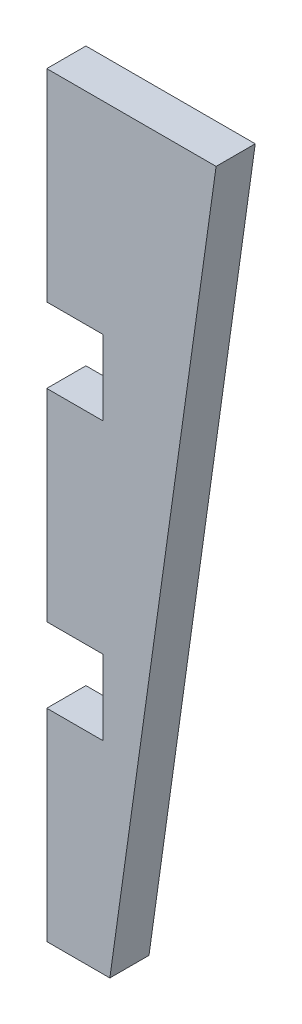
ISO-10303-21;
HEADER;
FILE_DESCRIPTION(('STEP AP214'),'2;1');
FILE_NAME('part.step','',(''),(''),'','','');
FILE_SCHEMA(('AUTOMOTIVE_DESIGN { 1 0 10303 214 1 1 1 1 }'));
ENDSEC;
DATA;
#1=APPLICATION_CONTEXT('core data for automotive mechanical design processes');
#2=APPLICATION_PROTOCOL_DEFINITION('international standard','automotive_design',2000,#1);
#3=PRODUCT_CONTEXT('',#1,'mechanical');
#4=PRODUCT('Part','Part','',(#3));
#5=PRODUCT_RELATED_PRODUCT_CATEGORY('part','',(#4));
#6=PRODUCT_DEFINITION_FORMATION('','',#4);
#7=PRODUCT_DEFINITION_CONTEXT('part definition',#1,'design');
#8=PRODUCT_DEFINITION('design','',#6,#7);
#9=PRODUCT_DEFINITION_SHAPE('','',#8);
#10=(LENGTH_UNIT() NAMED_UNIT(*) SI_UNIT(.MILLI.,.METRE.));
#11=(NAMED_UNIT(*) PLANE_ANGLE_UNIT() SI_UNIT($,.RADIAN.));
#12=(NAMED_UNIT(*) SI_UNIT($,.STERADIAN.) SOLID_ANGLE_UNIT());
#13=UNCERTAINTY_MEASURE_WITH_UNIT(LENGTH_MEASURE(1.E-05),#10,'distance_accuracy_value','');
#14=(GEOMETRIC_REPRESENTATION_CONTEXT(3) GLOBAL_UNCERTAINTY_ASSIGNED_CONTEXT((#13)) GLOBAL_UNIT_ASSIGNED_CONTEXT((#10,
#11,#12)) REPRESENTATION_CONTEXT('',''));
#15=CARTESIAN_POINT('',(0.,0.,0.));
#16=DIRECTION('',(0.,0.,1.));
#17=DIRECTION('',(1.,0.,0.));
#18=AXIS2_PLACEMENT_3D('',#15,#16,#17);
#19=CARTESIAN_POINT('',(4.49999999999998,208.,2.615));
#20=DIRECTION('',(1.,0.,0.));
#21=DIRECTION('',(0.,1.,0.));
#22=AXIS2_PLACEMENT_3D('',#19,#20,#21);
#23=PLANE('',#22);
#24=DIRECTION('',(0.,-1.,0.));
#25=VECTOR('',#24,1.);
#26=CARTESIAN_POINT('',(4.49999999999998,208.,-2.615));
#27=LINE('',#26,#25);
#28=CARTESIAN_POINT('',(4.49999999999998,156.,-2.615));
#29=VERTEX_POINT('',#28);
#30=CARTESIAN_POINT('',(4.49999999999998,129.,-2.615));
#31=VERTEX_POINT('',#30);
#32=EDGE_CURVE('E149',#29,#31,#27,.T.);
#33=ORIENTED_EDGE('',*,*,#32,.T.);
#34=DIRECTION('',(0.,0.,1.));
#35=VECTOR('',#34,1.);
#36=CARTESIAN_POINT('',(4.49999999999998,129.,-2.615));
#37=LINE('',#36,#35);
#38=CARTESIAN_POINT('',(4.49999999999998,129.,2.615));
#39=VERTEX_POINT('',#38);
#40=EDGE_CURVE('E201',#31,#39,#37,.T.);
#41=ORIENTED_EDGE('',*,*,#40,.T.);
#42=DIRECTION('',(0.,-1.,0.));
#43=VECTOR('',#42,1.);
#44=CARTESIAN_POINT('',(4.49999999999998,208.,2.615));
#45=LINE('',#44,#43);
#46=CARTESIAN_POINT('',(4.49999999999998,156.,2.615));
#47=VERTEX_POINT('',#46);
#48=EDGE_CURVE('E44',#47,#39,#45,.T.);
#49=ORIENTED_EDGE('',*,*,#48,.F.);
#50=DIRECTION('',(0.,0.,1.));
#51=VECTOR('',#50,1.);
#52=CARTESIAN_POINT('',(4.49999999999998,156.,-2.615));
#53=LINE('',#52,#51);
#54=EDGE_CURVE('E184',#29,#47,#53,.T.);
#55=ORIENTED_EDGE('',*,*,#54,.F.);
#56=EDGE_LOOP('',(#33,#41,#49,#55));
#57=FACE_BOUND('',#56,.T.);
#58=ADVANCED_FACE('F35',(#57),#23,.F.);
#59=CARTESIAN_POINT('',(4.49999999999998,193.,-2.615));
#60=VERTEX_POINT('',#59);
#61=CARTESIAN_POINT('',(4.49999999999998,166.,-2.615));
#62=VERTEX_POINT('',#61);
#63=EDGE_CURVE('E39',#60,#62,#27,.T.);
#64=ORIENTED_EDGE('',*,*,#63,.T.);
#65=DIRECTION('',(0.,0.,1.));
#66=VECTOR('',#65,1.);
#67=CARTESIAN_POINT('',(4.49999999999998,166.,-2.615));
#68=LINE('',#67,#66);
#69=CARTESIAN_POINT('',(4.49999999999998,166.,2.615));
#70=VERTEX_POINT('',#69);
#71=EDGE_CURVE('E182',#62,#70,#68,.T.);
#72=ORIENTED_EDGE('',*,*,#71,.T.);
#73=CARTESIAN_POINT('',(4.49999999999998,193.,2.615));
#74=VERTEX_POINT('',#73);
#75=EDGE_CURVE('E11',#74,#70,#45,.T.);
#76=ORIENTED_EDGE('',*,*,#75,.F.);
#77=DIRECTION('',(0.,0.,1.));
#78=VECTOR('',#77,1.);
#79=CARTESIAN_POINT('',(4.49999999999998,193.,-2.615));
#80=LINE('',#79,#78);
#81=EDGE_CURVE('E166',#60,#74,#80,.T.);
#82=ORIENTED_EDGE('',*,*,#81,.F.);
#83=EDGE_LOOP('',(#64,#72,#76,#82));
#84=FACE_BOUND('',#83,.T.);
#85=ADVANCED_FACE('F239',(#84),#23,.F.);
#86=CARTESIAN_POINT('',(29.2324936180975,208.,2.61500000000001));
#87=DIRECTION('',(-0.990268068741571,0.139173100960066,0.));
#88=DIRECTION('',(-0.139173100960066,-0.99026806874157,0.));
#89=AXIS2_PLACEMENT_3D('',#86,#87,#88);
#90=PLANE('',#89);
#91=DIRECTION('',(0.139173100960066,0.99026806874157,0.));
#92=VECTOR('',#91,1.);
#93=CARTESIAN_POINT('',(29.2324936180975,208.,2.61500000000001));
#94=LINE('',#93,#92);
#95=CARTESIAN_POINT('',(12.9297567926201,92.,2.615));
#96=VERTEX_POINT('',#95);
#97=CARTESIAN_POINT('',(27.1243810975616,193.,2.615));
#98=VERTEX_POINT('',#97);
#99=EDGE_CURVE('E154',#96,#98,#94,.T.);
#100=ORIENTED_EDGE('',*,*,#99,.F.);
#101=DIRECTION('',(0.,0.,1.));
#102=VECTOR('',#101,1.);
#103=CARTESIAN_POINT('',(12.9297567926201,92.,-2.615));
#104=LINE('',#103,#102);
#105=CARTESIAN_POINT('',(12.9297567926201,92.,-2.615));
#106=VERTEX_POINT('',#105);
#107=EDGE_CURVE('E176',#106,#96,#104,.T.);
#108=ORIENTED_EDGE('',*,*,#107,.F.);
#109=DIRECTION('',(0.139173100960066,0.99026806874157,0.));
#110=VECTOR('',#109,1.);
#111=CARTESIAN_POINT('',(29.2324936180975,208.,-2.615));
#112=LINE('',#111,#110);
#113=CARTESIAN_POINT('',(27.1243810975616,193.,-2.615));
#114=VERTEX_POINT('',#113);
#115=EDGE_CURVE('E150',#106,#114,#112,.T.);
#116=ORIENTED_EDGE('',*,*,#115,.T.);
#117=DIRECTION('',(0.,0.,1.));
#118=VECTOR('',#117,1.);
#119=CARTESIAN_POINT('',(27.1243810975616,193.,-2.615));
#120=LINE('',#119,#118);
#121=EDGE_CURVE('E152',#114,#98,#120,.T.);
#122=ORIENTED_EDGE('',*,*,#121,.T.);
#123=EDGE_LOOP('',(#100,#108,#116,#122));
#124=FACE_BOUND('',#123,.T.);
#125=ADVANCED_FACE('F37',(#124),#90,.F.);
#126=CARTESIAN_POINT('',(4.49999999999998,119.,2.615));
#127=VERTEX_POINT('',#126);
#128=CARTESIAN_POINT('',(4.49999999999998,92.,2.615));
#129=VERTEX_POINT('',#128);
#130=EDGE_CURVE('E46',#127,#129,#45,.T.);
#131=ORIENTED_EDGE('',*,*,#130,.F.);
#132=DIRECTION('',(0.,0.,1.));
#133=VECTOR('',#132,1.);
#134=CARTESIAN_POINT('',(4.49999999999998,119.,-2.615));
#135=LINE('',#134,#133);
#136=CARTESIAN_POINT('',(4.49999999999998,119.,-2.615));
#137=VERTEX_POINT('',#136);
#138=EDGE_CURVE('E130',#137,#127,#135,.T.);
#139=ORIENTED_EDGE('',*,*,#138,.F.);
#140=CARTESIAN_POINT('',(4.49999999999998,92.,-2.615));
#141=VERTEX_POINT('',#140);
#142=EDGE_CURVE('E141',#137,#141,#27,.T.);
#143=ORIENTED_EDGE('',*,*,#142,.T.);
#144=DIRECTION('',(0.,0.,1.));
#145=VECTOR('',#144,1.);
#146=CARTESIAN_POINT('',(4.49999999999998,92.,-2.615));
#147=LINE('',#146,#145);
#148=EDGE_CURVE('E173',#141,#129,#147,.T.);
#149=ORIENTED_EDGE('',*,*,#148,.T.);
#150=EDGE_LOOP('',(#131,#139,#143,#149));
#151=FACE_BOUND('',#150,.T.);
#152=ADVANCED_FACE('F139',(#151),#23,.F.);
#153=CARTESIAN_POINT('',(0.,0.,2.615));
#154=DIRECTION('',(0.,0.,1.));
#155=DIRECTION('',(1.,0.,0.));
#156=AXIS2_PLACEMENT_3D('',#153,#154,#155);
#157=PLANE('',#156);
#158=DIRECTION('',(-1.,0.,0.));
#159=VECTOR('',#158,1.);
#160=CARTESIAN_POINT('',(4.49999999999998,129.,2.615));
#161=LINE('',#160,#159);
#162=CARTESIAN_POINT('',(12.,129.,2.615));
#163=VERTEX_POINT('',#162);
#164=EDGE_CURVE('E135',#163,#39,#161,.T.);
#165=ORIENTED_EDGE('',*,*,#164,.F.);
#166=DIRECTION('',(0.,1.,0.));
#167=VECTOR('',#166,1.);
#168=CARTESIAN_POINT('',(12.,129.,2.615));
#169=LINE('',#168,#167);
#170=CARTESIAN_POINT('',(12.,119.,2.615));
#171=VERTEX_POINT('',#170);
#172=EDGE_CURVE('E213',#171,#163,#169,.T.);
#173=ORIENTED_EDGE('',*,*,#172,.F.);
#174=DIRECTION('',(1.,0.,0.));
#175=VECTOR('',#174,1.);
#176=CARTESIAN_POINT('',(4.49999999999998,119.,2.615));
#177=LINE('',#176,#175);
#178=EDGE_CURVE('E216',#127,#171,#177,.T.);
#179=ORIENTED_EDGE('',*,*,#178,.F.);
#180=ORIENTED_EDGE('',*,*,#130,.T.);
#181=DIRECTION('',(-1.,0.,0.));
#182=VECTOR('',#181,1.);
#183=CARTESIAN_POINT('',(4.49999999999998,92.,2.615));
#184=LINE('',#183,#182);
#185=EDGE_CURVE('E179',#96,#129,#184,.T.);
#186=ORIENTED_EDGE('',*,*,#185,.F.);
#187=ORIENTED_EDGE('',*,*,#99,.T.);
#188=DIRECTION('',(1.,0.,0.));
#189=VECTOR('',#188,1.);
#190=CARTESIAN_POINT('',(4.49999999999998,193.,2.615));
#191=LINE('',#190,#189);
#192=EDGE_CURVE('E171',#74,#98,#191,.T.);
#193=ORIENTED_EDGE('',*,*,#192,.F.);
#194=ORIENTED_EDGE('',*,*,#75,.T.);
#195=DIRECTION('',(-1.,0.,0.));
#196=VECTOR('',#195,1.);
#197=CARTESIAN_POINT('',(4.49999999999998,166.,2.615));
#198=LINE('',#197,#196);
#199=CARTESIAN_POINT('',(12.,166.,2.615));
#200=VERTEX_POINT('',#199);
#201=EDGE_CURVE('E192',#200,#70,#198,.T.);
#202=ORIENTED_EDGE('',*,*,#201,.F.);
#203=DIRECTION('',(0.,1.,0.));
#204=VECTOR('',#203,1.);
#205=CARTESIAN_POINT('',(12.,166.,2.615));
#206=LINE('',#205,#204);
#207=CARTESIAN_POINT('',(12.,156.,2.615));
#208=VERTEX_POINT('',#207);
#209=EDGE_CURVE('E195',#208,#200,#206,.T.);
#210=ORIENTED_EDGE('',*,*,#209,.F.);
#211=DIRECTION('',(1.,0.,0.));
#212=VECTOR('',#211,1.);
#213=CARTESIAN_POINT('',(4.49999999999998,156.,2.615));
#214=LINE('',#213,#212);
#215=EDGE_CURVE('E198',#47,#208,#214,.T.);
#216=ORIENTED_EDGE('',*,*,#215,.F.);
#217=ORIENTED_EDGE('',*,*,#48,.T.);
#218=EDGE_LOOP('',(#165,#173,#179,#180,#186,#187,#193,#194,#202,#210,#216,#217));
#219=FACE_BOUND('',#218,.T.);
#220=ADVANCED_FACE('F232',(#219),#157,.T.);
#221=CARTESIAN_POINT('',(0.,0.,-2.615));
#222=DIRECTION('',(0.,0.,1.));
#223=DIRECTION('',(1.,0.,0.));
#224=AXIS2_PLACEMENT_3D('',#221,#222,#223);
#225=PLANE('',#224);
#226=DIRECTION('',(0.,1.,0.));
#227=VECTOR('',#226,1.);
#228=CARTESIAN_POINT('',(12.,129.,-2.615));
#229=LINE('',#228,#227);
#230=CARTESIAN_POINT('',(12.,119.,-2.615));
#231=VERTEX_POINT('',#230);
#232=CARTESIAN_POINT('',(12.,129.,-2.615));
#233=VERTEX_POINT('',#232);
#234=EDGE_CURVE('E53',#231,#233,#229,.T.);
#235=ORIENTED_EDGE('',*,*,#234,.T.);
#236=DIRECTION('',(-1.,0.,0.));
#237=VECTOR('',#236,1.);
#238=CARTESIAN_POINT('',(4.49999999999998,129.,-2.615));
#239=LINE('',#238,#237);
#240=EDGE_CURVE('E143',#233,#31,#239,.T.);
#241=ORIENTED_EDGE('',*,*,#240,.T.);
#242=ORIENTED_EDGE('',*,*,#32,.F.);
#243=DIRECTION('',(1.,0.,0.));
#244=VECTOR('',#243,1.);
#245=CARTESIAN_POINT('',(4.49999999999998,156.,-2.615));
#246=LINE('',#245,#244);
#247=CARTESIAN_POINT('',(12.,156.,-2.615));
#248=VERTEX_POINT('',#247);
#249=EDGE_CURVE('E194',#29,#248,#246,.T.);
#250=ORIENTED_EDGE('',*,*,#249,.T.);
#251=DIRECTION('',(0.,1.,0.));
#252=VECTOR('',#251,1.);
#253=CARTESIAN_POINT('',(12.,166.,-2.615));
#254=LINE('',#253,#252);
#255=CARTESIAN_POINT('',(12.,166.,-2.615));
#256=VERTEX_POINT('',#255);
#257=EDGE_CURVE('E61',#248,#256,#254,.T.);
#258=ORIENTED_EDGE('',*,*,#257,.T.);
#259=DIRECTION('',(-1.,0.,0.));
#260=VECTOR('',#259,1.);
#261=CARTESIAN_POINT('',(4.49999999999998,166.,-2.615));
#262=LINE('',#261,#260);
#263=EDGE_CURVE('E187',#256,#62,#262,.T.);
#264=ORIENTED_EDGE('',*,*,#263,.T.);
#265=ORIENTED_EDGE('',*,*,#63,.F.);
#266=DIRECTION('',(1.,0.,0.));
#267=VECTOR('',#266,1.);
#268=CARTESIAN_POINT('',(4.49999999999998,193.,-2.615));
#269=LINE('',#268,#267);
#270=EDGE_CURVE('E168',#60,#114,#269,.T.);
#271=ORIENTED_EDGE('',*,*,#270,.T.);
#272=ORIENTED_EDGE('',*,*,#115,.F.);
#273=DIRECTION('',(-1.,0.,0.));
#274=VECTOR('',#273,1.);
#275=CARTESIAN_POINT('',(4.49999999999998,92.,-2.615));
#276=LINE('',#275,#274);
#277=EDGE_CURVE('E148',#106,#141,#276,.T.);
#278=ORIENTED_EDGE('',*,*,#277,.T.);
#279=ORIENTED_EDGE('',*,*,#142,.F.);
#280=DIRECTION('',(1.,0.,0.));
#281=VECTOR('',#280,1.);
#282=CARTESIAN_POINT('',(4.49999999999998,119.,-2.615));
#283=LINE('',#282,#281);
#284=EDGE_CURVE('E126',#137,#231,#283,.T.);
#285=ORIENTED_EDGE('',*,*,#284,.T.);
#286=EDGE_LOOP('',(#235,#241,#242,#250,#258,#264,#265,#271,#272,#278,#279,#285));
#287=FACE_BOUND('',#286,.T.);
#288=ADVANCED_FACE('F146',(#287),#225,.F.);
#289=CARTESIAN_POINT('',(4.49999999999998,193.,-2.615));
#290=DIRECTION('',(0.,-1.,0.));
#291=DIRECTION('',(0.,0.,-1.));
#292=AXIS2_PLACEMENT_3D('',#289,#290,#291);
#293=PLANE('',#292);
#294=ORIENTED_EDGE('',*,*,#192,.T.);
#295=ORIENTED_EDGE('',*,*,#121,.F.);
#296=ORIENTED_EDGE('',*,*,#270,.F.);
#297=ORIENTED_EDGE('',*,*,#81,.T.);
#298=EDGE_LOOP('',(#294,#295,#296,#297));
#299=FACE_BOUND('',#298,.T.);
#300=ADVANCED_FACE('F242',(#299),#293,.F.);
#301=CARTESIAN_POINT('',(4.49999999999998,92.,-2.615));
#302=DIRECTION('',(0.,1.,0.));
#303=DIRECTION('',(0.,0.,1.));
#304=AXIS2_PLACEMENT_3D('',#301,#302,#303);
#305=PLANE('',#304);
#306=ORIENTED_EDGE('',*,*,#185,.T.);
#307=ORIENTED_EDGE('',*,*,#148,.F.);
#308=ORIENTED_EDGE('',*,*,#277,.F.);
#309=ORIENTED_EDGE('',*,*,#107,.T.);
#310=EDGE_LOOP('',(#306,#307,#308,#309));
#311=FACE_BOUND('',#310,.T.);
#312=ADVANCED_FACE('F246',(#311),#305,.F.);
#313=CARTESIAN_POINT('',(4.49999999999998,166.,-2.615));
#314=DIRECTION('',(0.,1.,0.));
#315=DIRECTION('',(0.,0.,1.));
#316=AXIS2_PLACEMENT_3D('',#313,#314,#315);
#317=PLANE('',#316);
#318=ORIENTED_EDGE('',*,*,#201,.T.);
#319=ORIENTED_EDGE('',*,*,#71,.F.);
#320=ORIENTED_EDGE('',*,*,#263,.F.);
#321=DIRECTION('',(0.,0.,1.));
#322=VECTOR('',#321,1.);
#323=CARTESIAN_POINT('',(12.,166.,-2.615));
#324=LINE('',#323,#322);
#325=EDGE_CURVE('E189',#256,#200,#324,.T.);
#326=ORIENTED_EDGE('',*,*,#325,.T.);
#327=EDGE_LOOP('',(#318,#319,#320,#326));
#328=FACE_BOUND('',#327,.T.);
#329=ADVANCED_FACE('F237',(#328),#317,.F.);
#330=CARTESIAN_POINT('',(12.,166.,-2.615));
#331=DIRECTION('',(1.,0.,0.));
#332=DIRECTION('',(0.,1.,0.));
#333=AXIS2_PLACEMENT_3D('',#330,#331,#332);
#334=PLANE('',#333);
#335=ORIENTED_EDGE('',*,*,#209,.T.);
#336=ORIENTED_EDGE('',*,*,#325,.F.);
#337=ORIENTED_EDGE('',*,*,#257,.F.);
#338=DIRECTION('',(0.,0.,1.));
#339=VECTOR('',#338,1.);
#340=CARTESIAN_POINT('',(12.,156.,-2.615));
#341=LINE('',#340,#339);
#342=EDGE_CURVE('E186',#248,#208,#341,.T.);
#343=ORIENTED_EDGE('',*,*,#342,.T.);
#344=EDGE_LOOP('',(#335,#336,#337,#343));
#345=FACE_BOUND('',#344,.T.);
#346=ADVANCED_FACE('F234',(#345),#334,.F.);
#347=CARTESIAN_POINT('',(4.49999999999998,156.,-2.615));
#348=DIRECTION('',(0.,-1.,0.));
#349=DIRECTION('',(0.,0.,-1.));
#350=AXIS2_PLACEMENT_3D('',#347,#348,#349);
#351=PLANE('',#350);
#352=ORIENTED_EDGE('',*,*,#215,.T.);
#353=ORIENTED_EDGE('',*,*,#342,.F.);
#354=ORIENTED_EDGE('',*,*,#249,.F.);
#355=ORIENTED_EDGE('',*,*,#54,.T.);
#356=EDGE_LOOP('',(#352,#353,#354,#355));
#357=FACE_BOUND('',#356,.T.);
#358=ADVANCED_FACE('F229',(#357),#351,.F.);
#359=CARTESIAN_POINT('',(4.49999999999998,129.,-2.615));
#360=DIRECTION('',(0.,1.,0.));
#361=DIRECTION('',(0.,0.,1.));
#362=AXIS2_PLACEMENT_3D('',#359,#360,#361);
#363=PLANE('',#362);
#364=ORIENTED_EDGE('',*,*,#164,.T.);
#365=ORIENTED_EDGE('',*,*,#40,.F.);
#366=ORIENTED_EDGE('',*,*,#240,.F.);
#367=DIRECTION('',(0.,0.,1.));
#368=VECTOR('',#367,1.);
#369=CARTESIAN_POINT('',(12.,129.,-2.615));
#370=LINE('',#369,#368);
#371=EDGE_CURVE('E208',#233,#163,#370,.T.);
#372=ORIENTED_EDGE('',*,*,#371,.T.);
#373=EDGE_LOOP('',(#364,#365,#366,#372));
#374=FACE_BOUND('',#373,.T.);
#375=ADVANCED_FACE('F249',(#374),#363,.F.);
#376=CARTESIAN_POINT('',(12.,129.,-2.615));
#377=DIRECTION('',(1.,0.,0.));
#378=DIRECTION('',(0.,1.,0.));
#379=AXIS2_PLACEMENT_3D('',#376,#377,#378);
#380=PLANE('',#379);
#381=ORIENTED_EDGE('',*,*,#172,.T.);
#382=ORIENTED_EDGE('',*,*,#371,.F.);
#383=ORIENTED_EDGE('',*,*,#234,.F.);
#384=DIRECTION('',(0.,0.,1.));
#385=VECTOR('',#384,1.);
#386=CARTESIAN_POINT('',(12.,119.,-2.615));
#387=LINE('',#386,#385);
#388=EDGE_CURVE('E132',#231,#171,#387,.T.);
#389=ORIENTED_EDGE('',*,*,#388,.T.);
#390=EDGE_LOOP('',(#381,#382,#383,#389));
#391=FACE_BOUND('',#390,.T.);
#392=ADVANCED_FACE('F248',(#391),#380,.F.);
#393=CARTESIAN_POINT('',(4.49999999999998,119.,-2.615));
#394=DIRECTION('',(0.,-1.,0.));
#395=DIRECTION('',(0.,0.,-1.));
#396=AXIS2_PLACEMENT_3D('',#393,#394,#395);
#397=PLANE('',#396);
#398=ORIENTED_EDGE('',*,*,#178,.T.);
#399=ORIENTED_EDGE('',*,*,#388,.F.);
#400=ORIENTED_EDGE('',*,*,#284,.F.);
#401=ORIENTED_EDGE('',*,*,#138,.T.);
#402=EDGE_LOOP('',(#398,#399,#400,#401));
#403=FACE_BOUND('',#402,.T.);
#404=ADVANCED_FACE('F129',(#403),#397,.F.);
#405=CLOSED_SHELL('',(#58,#85,#125,#152,#220,#288,#300,#312,#329,#346,#358,#375,#392,#404));
#406=MANIFOLD_SOLID_BREP('B2',#405);
#407=ADVANCED_BREP_SHAPE_REPRESENTATION('',(#18,#406),#14);
#408=SHAPE_DEFINITION_REPRESENTATION(#9,#407);
ENDSEC;
END-ISO-10303-21;
